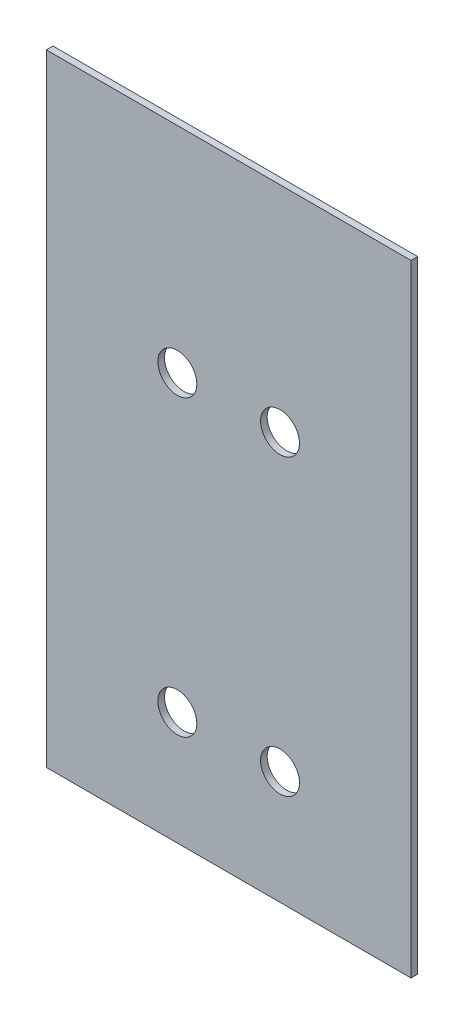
ISO-10303-21;
HEADER;
FILE_DESCRIPTION(('STEP AP214'),'2;1');
FILE_NAME('part.step','',(''),(''),'','','');
FILE_SCHEMA(('AUTOMOTIVE_DESIGN { 1 0 10303 214 1 1 1 1 }'));
ENDSEC;
DATA;
#1=APPLICATION_CONTEXT('core data for automotive mechanical design processes');
#2=APPLICATION_PROTOCOL_DEFINITION('international standard','automotive_design',2000,#1);
#3=PRODUCT_CONTEXT('',#1,'mechanical');
#4=PRODUCT('Part','Part','',(#3));
#5=PRODUCT_RELATED_PRODUCT_CATEGORY('part','',(#4));
#6=PRODUCT_DEFINITION_FORMATION('','',#4);
#7=PRODUCT_DEFINITION_CONTEXT('part definition',#1,'design');
#8=PRODUCT_DEFINITION('design','',#6,#7);
#9=PRODUCT_DEFINITION_SHAPE('','',#8);
#10=(LENGTH_UNIT() NAMED_UNIT(*) SI_UNIT(.MILLI.,.METRE.));
#11=(NAMED_UNIT(*) PLANE_ANGLE_UNIT() SI_UNIT($,.RADIAN.));
#12=(NAMED_UNIT(*) SI_UNIT($,.STERADIAN.) SOLID_ANGLE_UNIT());
#13=UNCERTAINTY_MEASURE_WITH_UNIT(LENGTH_MEASURE(1.E-05),#10,'distance_accuracy_value','');
#14=(GEOMETRIC_REPRESENTATION_CONTEXT(3) GLOBAL_UNCERTAINTY_ASSIGNED_CONTEXT((#13)) GLOBAL_UNIT_ASSIGNED_CONTEXT((#10,
#11,#12)) REPRESENTATION_CONTEXT('',''));
#15=CARTESIAN_POINT('',(0.,0.,0.));
#16=DIRECTION('',(0.,0.,1.));
#17=DIRECTION('',(1.,0.,0.));
#18=AXIS2_PLACEMENT_3D('',#15,#16,#17);
#19=CARTESIAN_POINT('',(-234.95,557.212500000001,11.90625));
#20=DIRECTION('',(0.,-1.,0.));
#21=DIRECTION('',(0.,0.,-1.));
#22=AXIS2_PLACEMENT_3D('',#19,#20,#21);
#23=PLANE('',#22);
#24=DIRECTION('',(-1.,0.,0.));
#25=VECTOR('',#24,1.);
#26=CARTESIAN_POINT('',(-234.95,557.212500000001,2.22044604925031E-13));
#27=LINE('',#26,#25);
#28=CARTESIAN_POINT('',(419.1,557.212500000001,2.22044604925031E-13));
#29=VERTEX_POINT('',#28);
#30=CARTESIAN_POINT('',(-234.95,557.212500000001,2.22044604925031E-13));
#31=VERTEX_POINT('',#30);
#32=EDGE_CURVE('E69',#29,#31,#27,.T.);
#33=ORIENTED_EDGE('',*,*,#32,.T.);
#34=DIRECTION('',(0.,0.,-1.));
#35=VECTOR('',#34,1.);
#36=CARTESIAN_POINT('',(-234.95,557.212500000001,11.90625));
#37=LINE('',#36,#35);
#38=CARTESIAN_POINT('',(-234.95,557.212500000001,11.90625));
#39=VERTEX_POINT('',#38);
#40=EDGE_CURVE('E11',#39,#31,#37,.T.);
#41=ORIENTED_EDGE('',*,*,#40,.F.);
#42=DIRECTION('',(-1.,0.,0.));
#43=VECTOR('',#42,1.);
#44=CARTESIAN_POINT('',(-234.95,557.212500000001,11.90625));
#45=LINE('',#44,#43);
#46=CARTESIAN_POINT('',(419.1,557.212500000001,11.90625));
#47=VERTEX_POINT('',#46);
#48=EDGE_CURVE('E133',#47,#39,#45,.T.);
#49=ORIENTED_EDGE('',*,*,#48,.F.);
#50=DIRECTION('',(0.,0.,1.));
#51=VECTOR('',#50,1.);
#52=CARTESIAN_POINT('',(419.1,557.212500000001,2.22044604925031E-13));
#53=LINE('',#52,#51);
#54=EDGE_CURVE('E100',#29,#47,#53,.T.);
#55=ORIENTED_EDGE('',*,*,#54,.F.);
#56=EDGE_LOOP('',(#33,#41,#49,#55));
#57=FACE_BOUND('',#56,.T.);
#58=ADVANCED_FACE('F41',(#57),#23,.F.);
#59=CARTESIAN_POINT('',(-234.95,-557.212500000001,11.9062500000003));
#60=DIRECTION('',(1.,0.,0.));
#61=DIRECTION('',(0.,0.,-1.));
#62=AXIS2_PLACEMENT_3D('',#59,#60,#61);
#63=PLANE('',#62);
#64=DIRECTION('',(0.,-1.,0.));
#65=VECTOR('',#64,1.);
#66=CARTESIAN_POINT('',(-234.95,-557.212500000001,2.22044604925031E-13));
#67=LINE('',#66,#65);
#68=CARTESIAN_POINT('',(-234.95,-557.212500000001,2.22044604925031E-13));
#69=VERTEX_POINT('',#68);
#70=EDGE_CURVE('E140',#31,#69,#67,.T.);
#71=ORIENTED_EDGE('',*,*,#70,.T.);
#72=DIRECTION('',(0.,0.,-1.));
#73=VECTOR('',#72,1.);
#74=CARTESIAN_POINT('',(-234.95,-557.212500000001,11.9062500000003));
#75=LINE('',#74,#73);
#76=CARTESIAN_POINT('',(-234.95,-557.212500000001,11.9062500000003));
#77=VERTEX_POINT('',#76);
#78=EDGE_CURVE('E50',#77,#69,#75,.T.);
#79=ORIENTED_EDGE('',*,*,#78,.F.);
#80=DIRECTION('',(0.,-1.,0.));
#81=VECTOR('',#80,1.);
#82=CARTESIAN_POINT('',(-234.95,-557.212500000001,11.9062500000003));
#83=LINE('',#82,#81);
#84=EDGE_CURVE('E58',#39,#77,#83,.T.);
#85=ORIENTED_EDGE('',*,*,#84,.F.);
#86=ORIENTED_EDGE('',*,*,#40,.T.);
#87=EDGE_LOOP('',(#71,#79,#85,#86));
#88=FACE_BOUND('',#87,.T.);
#89=ADVANCED_FACE('F150',(#88),#63,.F.);
#90=CARTESIAN_POINT('',(-234.95,-557.212500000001,11.9062500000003));
#91=DIRECTION('',(0.,1.,0.));
#92=DIRECTION('',(0.,0.,1.));
#93=AXIS2_PLACEMENT_3D('',#90,#91,#92);
#94=PLANE('',#93);
#95=DIRECTION('',(1.,0.,0.));
#96=VECTOR('',#95,1.);
#97=CARTESIAN_POINT('',(-234.95,-557.212500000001,2.22044604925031E-13));
#98=LINE('',#97,#96);
#99=CARTESIAN_POINT('',(419.1,-557.212500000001,2.22044604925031E-13));
#100=VERTEX_POINT('',#99);
#101=EDGE_CURVE('E78',#69,#100,#98,.T.);
#102=ORIENTED_EDGE('',*,*,#101,.T.);
#103=DIRECTION('',(0.,0.,1.));
#104=VECTOR('',#103,1.);
#105=CARTESIAN_POINT('',(419.1,-557.212500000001,2.22044604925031E-13));
#106=LINE('',#105,#104);
#107=CARTESIAN_POINT('',(419.1,-557.212500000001,11.9062500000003));
#108=VERTEX_POINT('',#107);
#109=EDGE_CURVE('E94',#100,#108,#106,.T.);
#110=ORIENTED_EDGE('',*,*,#109,.T.);
#111=DIRECTION('',(1.,0.,0.));
#112=VECTOR('',#111,1.);
#113=CARTESIAN_POINT('',(-234.95,-557.212500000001,11.9062500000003));
#114=LINE('',#113,#112);
#115=EDGE_CURVE('E87',#77,#108,#114,.T.);
#116=ORIENTED_EDGE('',*,*,#115,.F.);
#117=ORIENTED_EDGE('',*,*,#78,.T.);
#118=EDGE_LOOP('',(#102,#110,#116,#117));
#119=FACE_BOUND('',#118,.T.);
#120=ADVANCED_FACE('F95',(#119),#94,.F.);
#121=CARTESIAN_POINT('',(0.,0.,11.90625));
#122=DIRECTION('',(0.,0.,-1.));
#123=DIRECTION('',(-1.,0.,0.));
#124=AXIS2_PLACEMENT_3D('',#121,#122,#123);
#125=PLANE('',#124);
#126=CARTESIAN_POINT('',(184.15,173.0375,11.90625));
#127=DIRECTION('',(0.,0.,1.));
#128=DIRECTION('',(1.,0.,0.));
#129=AXIS2_PLACEMENT_3D('',#126,#127,#128);
#130=CIRCLE('',#129,34.925);
#131=CARTESIAN_POINT('',(219.075,173.0375,11.90625));
#132=VERTEX_POINT('',#131);
#133=EDGE_CURVE('E189',#132,#132,#130,.T.);
#134=ORIENTED_EDGE('',*,*,#133,.F.);
#135=EDGE_LOOP('',(#134));
#136=FACE_BOUND('',#135,.T.);
#137=CARTESIAN_POINT('',(184.15,-354.012500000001,11.90625));
#138=DIRECTION('',(0.,0.,1.));
#139=DIRECTION('',(1.,0.,0.));
#140=AXIS2_PLACEMENT_3D('',#137,#138,#139);
#141=CIRCLE('',#140,34.925);
#142=CARTESIAN_POINT('',(219.075,-354.012500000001,11.90625));
#143=VERTEX_POINT('',#142);
#144=EDGE_CURVE('E113',#143,#143,#141,.T.);
#145=ORIENTED_EDGE('',*,*,#144,.F.);
#146=EDGE_LOOP('',(#145));
#147=FACE_BOUND('',#146,.T.);
#148=CARTESIAN_POINT('',(0.,173.0375,11.9062500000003));
#149=DIRECTION('',(0.,0.,1.));
#150=DIRECTION('',(1.,0.,0.));
#151=AXIS2_PLACEMENT_3D('',#148,#149,#150);
#152=CIRCLE('',#151,34.925);
#153=CARTESIAN_POINT('',(34.925,173.0375,11.9062500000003));
#154=VERTEX_POINT('',#153);
#155=EDGE_CURVE('E99',#154,#154,#152,.T.);
#156=ORIENTED_EDGE('',*,*,#155,.F.);
#157=EDGE_LOOP('',(#156));
#158=FACE_BOUND('',#157,.T.);
#159=CARTESIAN_POINT('',(0.,-354.0125,11.9062500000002));
#160=DIRECTION('',(0.,0.,1.));
#161=DIRECTION('',(1.,0.,0.));
#162=AXIS2_PLACEMENT_3D('',#159,#160,#161);
#163=CIRCLE('',#162,34.925);
#164=CARTESIAN_POINT('',(34.925,-354.0125,11.9062500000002));
#165=VERTEX_POINT('',#164);
#166=EDGE_CURVE('E125',#165,#165,#163,.T.);
#167=ORIENTED_EDGE('',*,*,#166,.F.);
#168=EDGE_LOOP('',(#167));
#169=FACE_BOUND('',#168,.T.);
#170=ORIENTED_EDGE('',*,*,#115,.T.);
#171=DIRECTION('',(0.,-1.,0.));
#172=VECTOR('',#171,1.);
#173=CARTESIAN_POINT('',(419.1,0.,11.90625));
#174=LINE('',#173,#172);
#175=EDGE_CURVE('E90',#47,#108,#174,.T.);
#176=ORIENTED_EDGE('',*,*,#175,.F.);
#177=ORIENTED_EDGE('',*,*,#48,.T.);
#178=ORIENTED_EDGE('',*,*,#84,.T.);
#179=EDGE_LOOP('',(#170,#176,#177,#178));
#180=FACE_BOUND('',#179,.T.);
#181=ADVANCED_FACE('F88',(#136,#147,#158,#169,#180),#125,.F.);
#182=CARTESIAN_POINT('',(0.,0.,0.));
#183=DIRECTION('',(0.,0.,-1.));
#184=DIRECTION('',(-1.,0.,0.));
#185=AXIS2_PLACEMENT_3D('',#182,#183,#184);
#186=PLANE('',#185);
#187=CARTESIAN_POINT('',(184.15,173.0375,0.));
#188=DIRECTION('',(0.,0.,1.));
#189=DIRECTION('',(1.,0.,0.));
#190=AXIS2_PLACEMENT_3D('',#187,#188,#189);
#191=CIRCLE('',#190,34.925);
#192=CARTESIAN_POINT('',(219.075,173.0375,0.));
#193=VERTEX_POINT('',#192);
#194=EDGE_CURVE('E186',#193,#193,#191,.T.);
#195=ORIENTED_EDGE('',*,*,#194,.T.);
#196=EDGE_LOOP('',(#195));
#197=FACE_BOUND('',#196,.T.);
#198=CARTESIAN_POINT('',(184.15,-354.0125,0.));
#199=DIRECTION('',(0.,0.,1.));
#200=DIRECTION('',(1.,0.,0.));
#201=AXIS2_PLACEMENT_3D('',#198,#199,#200);
#202=CIRCLE('',#201,34.925);
#203=CARTESIAN_POINT('',(219.075,-354.0125,0.));
#204=VERTEX_POINT('',#203);
#205=EDGE_CURVE('E106',#204,#204,#202,.T.);
#206=ORIENTED_EDGE('',*,*,#205,.T.);
#207=EDGE_LOOP('',(#206));
#208=FACE_BOUND('',#207,.T.);
#209=CARTESIAN_POINT('',(0.,173.0375,2.22044604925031E-13));
#210=DIRECTION('',(0.,0.,1.));
#211=DIRECTION('',(1.,0.,0.));
#212=AXIS2_PLACEMENT_3D('',#209,#210,#211);
#213=CIRCLE('',#212,34.925);
#214=CARTESIAN_POINT('',(34.925,173.0375,2.22044604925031E-13));
#215=VERTEX_POINT('',#214);
#216=EDGE_CURVE('E121',#215,#215,#213,.T.);
#217=ORIENTED_EDGE('',*,*,#216,.T.);
#218=EDGE_LOOP('',(#217));
#219=FACE_BOUND('',#218,.T.);
#220=CARTESIAN_POINT('',(0.,-354.0125,1.11022302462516E-13));
#221=DIRECTION('',(0.,0.,1.));
#222=DIRECTION('',(1.,0.,0.));
#223=AXIS2_PLACEMENT_3D('',#220,#221,#222);
#224=CIRCLE('',#223,34.925);
#225=CARTESIAN_POINT('',(34.925,-354.0125,1.11022302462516E-13));
#226=VERTEX_POINT('',#225);
#227=EDGE_CURVE('E129',#226,#226,#224,.T.);
#228=ORIENTED_EDGE('',*,*,#227,.T.);
#229=EDGE_LOOP('',(#228));
#230=FACE_BOUND('',#229,.T.);
#231=ORIENTED_EDGE('',*,*,#32,.F.);
#232=DIRECTION('',(0.,-1.,0.));
#233=VECTOR('',#232,1.);
#234=CARTESIAN_POINT('',(419.1,0.,0.));
#235=LINE('',#234,#233);
#236=EDGE_CURVE('E105',#29,#100,#235,.T.);
#237=ORIENTED_EDGE('',*,*,#236,.T.);
#238=ORIENTED_EDGE('',*,*,#101,.F.);
#239=ORIENTED_EDGE('',*,*,#70,.F.);
#240=EDGE_LOOP('',(#231,#237,#238,#239));
#241=FACE_BOUND('',#240,.T.);
#242=ADVANCED_FACE('F149',(#197,#208,#219,#230,#241),#186,.T.);
#243=CARTESIAN_POINT('',(0.,-354.0125,11.9062500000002));
#244=DIRECTION('',(0.,0.,1.));
#245=DIRECTION('',(1.,0.,0.));
#246=AXIS2_PLACEMENT_3D('',#243,#244,#245);
#247=CYLINDRICAL_SURFACE('',#246,34.925);
#248=ORIENTED_EDGE('',*,*,#227,.F.);
#249=EDGE_LOOP('',(#248));
#250=FACE_BOUND('',#249,.T.);
#251=ORIENTED_EDGE('',*,*,#166,.T.);
#252=EDGE_LOOP('',(#251));
#253=FACE_BOUND('',#252,.T.);
#254=ADVANCED_FACE('F160',(#250,#253),#247,.F.);
#255=CARTESIAN_POINT('',(0.,173.0375,11.9062500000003));
#256=DIRECTION('',(0.,0.,1.));
#257=DIRECTION('',(1.,0.,0.));
#258=AXIS2_PLACEMENT_3D('',#255,#256,#257);
#259=CYLINDRICAL_SURFACE('',#258,34.925);
#260=ORIENTED_EDGE('',*,*,#216,.F.);
#261=EDGE_LOOP('',(#260));
#262=FACE_BOUND('',#261,.T.);
#263=ORIENTED_EDGE('',*,*,#155,.T.);
#264=EDGE_LOOP('',(#263));
#265=FACE_BOUND('',#264,.T.);
#266=ADVANCED_FACE('F167',(#262,#265),#259,.F.);
#267=CARTESIAN_POINT('',(419.1,0.,0.));
#268=DIRECTION('',(-1.,0.,0.));
#269=DIRECTION('',(0.,-1.,0.));
#270=AXIS2_PLACEMENT_3D('',#267,#268,#269);
#271=PLANE('',#270);
#272=ORIENTED_EDGE('',*,*,#175,.T.);
#273=ORIENTED_EDGE('',*,*,#109,.F.);
#274=ORIENTED_EDGE('',*,*,#236,.F.);
#275=ORIENTED_EDGE('',*,*,#54,.T.);
#276=EDGE_LOOP('',(#272,#273,#274,#275));
#277=FACE_BOUND('',#276,.T.);
#278=ADVANCED_FACE('F103',(#277),#271,.F.);
#279=CARTESIAN_POINT('',(184.15,-354.012500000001,11.90625));
#280=DIRECTION('',(0.,0.,1.));
#281=DIRECTION('',(1.,0.,0.));
#282=AXIS2_PLACEMENT_3D('',#279,#280,#281);
#283=CYLINDRICAL_SURFACE('',#282,34.925);
#284=ORIENTED_EDGE('',*,*,#205,.F.);
#285=EDGE_LOOP('',(#284));
#286=FACE_BOUND('',#285,.T.);
#287=ORIENTED_EDGE('',*,*,#144,.T.);
#288=EDGE_LOOP('',(#287));
#289=FACE_BOUND('',#288,.T.);
#290=ADVANCED_FACE('F174',(#286,#289),#283,.F.);
#291=CARTESIAN_POINT('',(184.15,173.0375,11.90625));
#292=DIRECTION('',(0.,0.,1.));
#293=DIRECTION('',(1.,0.,0.));
#294=AXIS2_PLACEMENT_3D('',#291,#292,#293);
#295=CYLINDRICAL_SURFACE('',#294,34.925);
#296=ORIENTED_EDGE('',*,*,#194,.F.);
#297=EDGE_LOOP('',(#296));
#298=FACE_BOUND('',#297,.T.);
#299=ORIENTED_EDGE('',*,*,#133,.T.);
#300=EDGE_LOOP('',(#299));
#301=FACE_BOUND('',#300,.T.);
#302=ADVANCED_FACE('F177',(#298,#301),#295,.F.);
#303=CLOSED_SHELL('',(#58,#89,#120,#181,#242,#254,#266,#278,#290,#302));
#304=MANIFOLD_SOLID_BREP('B2',#303);
#305=ADVANCED_BREP_SHAPE_REPRESENTATION('',(#18,#304),#14);
#306=SHAPE_DEFINITION_REPRESENTATION(#9,#305);
ENDSEC;
END-ISO-10303-21;
